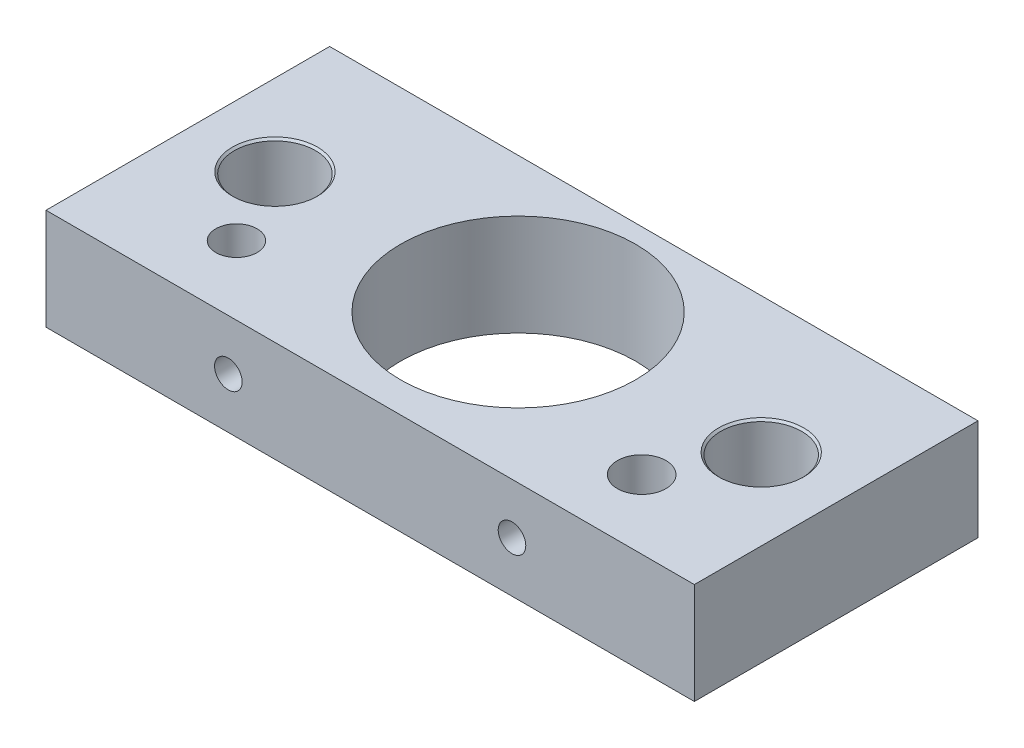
ISO-10303-21;
HEADER;
FILE_DESCRIPTION(('STEP AP214'),'2;1');
FILE_NAME('part.step','',(''),(''),'','','');
FILE_SCHEMA(('AUTOMOTIVE_DESIGN { 1 0 10303 214 1 1 1 1 }'));
ENDSEC;
DATA;
#1=APPLICATION_CONTEXT('core data for automotive mechanical design processes');
#2=APPLICATION_PROTOCOL_DEFINITION('international standard','automotive_design',2000,#1);
#3=PRODUCT_CONTEXT('',#1,'mechanical');
#4=PRODUCT('Part','Part','',(#3));
#5=PRODUCT_RELATED_PRODUCT_CATEGORY('part','',(#4));
#6=PRODUCT_DEFINITION_FORMATION('','',#4);
#7=PRODUCT_DEFINITION_CONTEXT('part definition',#1,'design');
#8=PRODUCT_DEFINITION('design','',#6,#7);
#9=PRODUCT_DEFINITION_SHAPE('','',#8);
#10=(LENGTH_UNIT() NAMED_UNIT(*) SI_UNIT(.MILLI.,.METRE.));
#11=(NAMED_UNIT(*) PLANE_ANGLE_UNIT() SI_UNIT($,.RADIAN.));
#12=(NAMED_UNIT(*) SI_UNIT($,.STERADIAN.) SOLID_ANGLE_UNIT());
#13=UNCERTAINTY_MEASURE_WITH_UNIT(LENGTH_MEASURE(1.E-05),#10,'distance_accuracy_value','');
#14=(GEOMETRIC_REPRESENTATION_CONTEXT(3) GLOBAL_UNCERTAINTY_ASSIGNED_CONTEXT((#13)) GLOBAL_UNIT_ASSIGNED_CONTEXT((#10,
#11,#12)) REPRESENTATION_CONTEXT('',''));
#15=CARTESIAN_POINT('',(0.,0.,0.));
#16=DIRECTION('',(0.,0.,1.));
#17=DIRECTION('',(1.,0.,0.));
#18=AXIS2_PLACEMENT_3D('',#15,#16,#17);
#19=CARTESIAN_POINT('',(0.,25.,0.));
#20=DIRECTION('',(1.,0.,0.));
#21=DIRECTION('',(0.,0.,-1.));
#22=AXIS2_PLACEMENT_3D('',#19,#20,#21);
#23=PLANE('',#22);
#24=DIRECTION('',(0.,0.,1.));
#25=VECTOR('',#24,1.);
#26=CARTESIAN_POINT('',(0.,0.,0.));
#27=LINE('',#26,#25);
#28=CARTESIAN_POINT('',(0.,0.,-70.));
#29=VERTEX_POINT('',#28);
#30=CARTESIAN_POINT('',(0.,0.,0.));
#31=VERTEX_POINT('',#30);
#32=EDGE_CURVE('E9218',#29,#31,#27,.T.);
#33=ORIENTED_EDGE('',*,*,#32,.T.);
#34=DIRECTION('',(0.,-1.,0.));
#35=VECTOR('',#34,1.);
#36=CARTESIAN_POINT('',(0.,25.,0.));
#37=LINE('',#36,#35);
#38=CARTESIAN_POINT('',(0.,25.,0.));
#39=VERTEX_POINT('',#38);
#40=EDGE_CURVE('E11',#39,#31,#37,.T.);
#41=ORIENTED_EDGE('',*,*,#40,.F.);
#42=DIRECTION('',(0.,0.,1.));
#43=VECTOR('',#42,1.);
#44=CARTESIAN_POINT('',(0.,25.,0.));
#45=LINE('',#44,#43);
#46=CARTESIAN_POINT('',(0.,25.,-70.));
#47=VERTEX_POINT('',#46);
#48=EDGE_CURVE('E9241',#47,#39,#45,.T.);
#49=ORIENTED_EDGE('',*,*,#48,.F.);
#50=DIRECTION('',(0.,-1.,0.));
#51=VECTOR('',#50,1.);
#52=CARTESIAN_POINT('',(0.,25.,-70.));
#53=LINE('',#52,#51);
#54=EDGE_CURVE('E9230',#47,#29,#53,.T.);
#55=ORIENTED_EDGE('',*,*,#54,.T.);
#56=EDGE_LOOP('',(#33,#41,#49,#55));
#57=FACE_BOUND('',#56,.T.);
#58=ADVANCED_FACE('F9174',(#57),#23,.F.);
#59=CARTESIAN_POINT('',(0.,25.,0.));
#60=DIRECTION('',(0.,0.,-1.));
#61=DIRECTION('',(-1.,0.,0.));
#62=AXIS2_PLACEMENT_3D('',#59,#60,#61);
#63=PLANE('',#62);
#64=CARTESIAN_POINT('',(115.,12.5,0.));
#65=DIRECTION('',(0.,0.,1.));
#66=DIRECTION('',(1.,0.,0.));
#67=AXIS2_PLACEMENT_3D('',#64,#65,#66);
#68=CIRCLE('',#67,3.39999999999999);
#69=CARTESIAN_POINT('',(118.4,12.5,0.));
#70=VERTEX_POINT('',#69);
#71=EDGE_CURVE('E9282',#70,#70,#68,.T.);
#72=ORIENTED_EDGE('',*,*,#71,.F.);
#73=EDGE_LOOP('',(#72));
#74=FACE_BOUND('',#73,.T.);
#75=CARTESIAN_POINT('',(45.,12.5,0.));
#76=DIRECTION('',(0.,0.,1.));
#77=DIRECTION('',(1.,0.,0.));
#78=AXIS2_PLACEMENT_3D('',#75,#76,#77);
#79=CIRCLE('',#78,3.39999999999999);
#80=CARTESIAN_POINT('',(48.4,12.5,0.));
#81=VERTEX_POINT('',#80);
#82=EDGE_CURVE('E9285',#81,#81,#79,.T.);
#83=ORIENTED_EDGE('',*,*,#82,.F.);
#84=EDGE_LOOP('',(#83));
#85=FACE_BOUND('',#84,.T.);
#86=DIRECTION('',(1.,0.,0.));
#87=VECTOR('',#86,1.);
#88=CARTESIAN_POINT('',(0.,0.,0.));
#89=LINE('',#88,#87);
#90=CARTESIAN_POINT('',(160.,0.,0.));
#91=VERTEX_POINT('',#90);
#92=EDGE_CURVE('E9214',#31,#91,#89,.T.);
#93=ORIENTED_EDGE('',*,*,#92,.T.);
#94=DIRECTION('',(0.,-1.,0.));
#95=VECTOR('',#94,1.);
#96=CARTESIAN_POINT('',(160.,25.,0.));
#97=LINE('',#96,#95);
#98=CARTESIAN_POINT('',(160.,25.,0.));
#99=VERTEX_POINT('',#98);
#100=EDGE_CURVE('E9181',#99,#91,#97,.T.);
#101=ORIENTED_EDGE('',*,*,#100,.F.);
#102=DIRECTION('',(1.,0.,0.));
#103=VECTOR('',#102,1.);
#104=CARTESIAN_POINT('',(0.,25.,0.));
#105=LINE('',#104,#103);
#106=EDGE_CURVE('E9226',#39,#99,#105,.T.);
#107=ORIENTED_EDGE('',*,*,#106,.F.);
#108=ORIENTED_EDGE('',*,*,#40,.T.);
#109=EDGE_LOOP('',(#93,#101,#107,#108));
#110=FACE_BOUND('',#109,.T.);
#111=ADVANCED_FACE('F9225',(#74,#85,#110),#63,.F.);
#112=CARTESIAN_POINT('',(160.,25.,0.));
#113=DIRECTION('',(-1.,0.,0.));
#114=DIRECTION('',(0.,0.,1.));
#115=AXIS2_PLACEMENT_3D('',#112,#113,#114);
#116=PLANE('',#115);
#117=DIRECTION('',(0.,0.,-1.));
#118=VECTOR('',#117,1.);
#119=CARTESIAN_POINT('',(160.,0.,0.));
#120=LINE('',#119,#118);
#121=CARTESIAN_POINT('',(160.,0.,-70.));
#122=VERTEX_POINT('',#121);
#123=EDGE_CURVE('E9219',#91,#122,#120,.T.);
#124=ORIENTED_EDGE('',*,*,#123,.T.);
#125=DIRECTION('',(0.,-1.,0.));
#126=VECTOR('',#125,1.);
#127=CARTESIAN_POINT('',(160.,25.,-70.));
#128=LINE('',#127,#126);
#129=CARTESIAN_POINT('',(160.,25.,-70.));
#130=VERTEX_POINT('',#129);
#131=EDGE_CURVE('E9247',#130,#122,#128,.T.);
#132=ORIENTED_EDGE('',*,*,#131,.F.);
#133=DIRECTION('',(0.,0.,-1.));
#134=VECTOR('',#133,1.);
#135=CARTESIAN_POINT('',(160.,25.,0.));
#136=LINE('',#135,#134);
#137=EDGE_CURVE('E9193',#99,#130,#136,.T.);
#138=ORIENTED_EDGE('',*,*,#137,.F.);
#139=ORIENTED_EDGE('',*,*,#100,.T.);
#140=EDGE_LOOP('',(#124,#132,#138,#139));
#141=FACE_BOUND('',#140,.T.);
#142=ADVANCED_FACE('F9250',(#141),#116,.F.);
#143=CARTESIAN_POINT('',(0.,25.,-70.));
#144=DIRECTION('',(0.,0.,1.));
#145=DIRECTION('',(1.,0.,0.));
#146=AXIS2_PLACEMENT_3D('',#143,#144,#145);
#147=PLANE('',#146);
#148=CARTESIAN_POINT('',(115.,12.5,-70.));
#149=DIRECTION('',(0.,0.,1.));
#150=DIRECTION('',(1.,0.,0.));
#151=AXIS2_PLACEMENT_3D('',#148,#149,#150);
#152=CIRCLE('',#151,3.39999999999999);
#153=CARTESIAN_POINT('',(118.4,12.5,-70.));
#154=VERTEX_POINT('',#153);
#155=EDGE_CURVE('E9382',#154,#154,#152,.T.);
#156=ORIENTED_EDGE('',*,*,#155,.T.);
#157=EDGE_LOOP('',(#156));
#158=FACE_BOUND('',#157,.T.);
#159=CARTESIAN_POINT('',(45.,12.5,-70.));
#160=DIRECTION('',(0.,0.,1.));
#161=DIRECTION('',(1.,0.,0.));
#162=AXIS2_PLACEMENT_3D('',#159,#160,#161);
#163=CIRCLE('',#162,3.39999999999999);
#164=CARTESIAN_POINT('',(48.4,12.5,-70.));
#165=VERTEX_POINT('',#164);
#166=EDGE_CURVE('E9288',#165,#165,#163,.T.);
#167=ORIENTED_EDGE('',*,*,#166,.T.);
#168=EDGE_LOOP('',(#167));
#169=FACE_BOUND('',#168,.T.);
#170=DIRECTION('',(-1.,0.,0.));
#171=VECTOR('',#170,1.);
#172=CARTESIAN_POINT('',(0.,0.,-70.));
#173=LINE('',#172,#171);
#174=EDGE_CURVE('E9239',#122,#29,#173,.T.);
#175=ORIENTED_EDGE('',*,*,#174,.T.);
#176=ORIENTED_EDGE('',*,*,#54,.F.);
#177=DIRECTION('',(-1.,0.,0.));
#178=VECTOR('',#177,1.);
#179=CARTESIAN_POINT('',(0.,25.,-70.));
#180=LINE('',#179,#178);
#181=EDGE_CURVE('E9188',#130,#47,#180,.T.);
#182=ORIENTED_EDGE('',*,*,#181,.F.);
#183=ORIENTED_EDGE('',*,*,#131,.T.);
#184=EDGE_LOOP('',(#175,#176,#182,#183));
#185=FACE_BOUND('',#184,.T.);
#186=ADVANCED_FACE('F9252',(#158,#169,#185),#147,.F.);
#187=CARTESIAN_POINT('',(0.,25.,-70.));
#188=DIRECTION('',(0.,-1.,0.));
#189=DIRECTION('',(0.,0.,-1.));
#190=AXIS2_PLACEMENT_3D('',#187,#188,#189);
#191=PLANE('',#190);
#192=CARTESIAN_POINT('',(80.,25.,-36.5));
#193=DIRECTION('',(0.,-1.,0.));
#194=DIRECTION('',(0.,0.,-1.));
#195=AXIS2_PLACEMENT_3D('',#192,#193,#194);
#196=CIRCLE('',#195,29.);
#197=CARTESIAN_POINT('',(80.,25.,-65.5));
#198=VERTEX_POINT('',#197);
#199=EDGE_CURVE('E9363',#198,#198,#196,.T.);
#200=ORIENTED_EDGE('',*,*,#199,.T.);
#201=EDGE_LOOP('',(#200));
#202=FACE_BOUND('',#201,.T.);
#203=CARTESIAN_POINT('',(30.,25.,-17.));
#204=DIRECTION('',(0.,-1.,0.));
#205=DIRECTION('',(0.,0.,-1.));
#206=AXIS2_PLACEMENT_3D('',#203,#204,#205);
#207=CIRCLE('',#206,5.09999999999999);
#208=CARTESIAN_POINT('',(30.,25.,-22.1));
#209=VERTEX_POINT('',#208);
#210=EDGE_CURVE('E9368',#209,#209,#207,.T.);
#211=ORIENTED_EDGE('',*,*,#210,.T.);
#212=EDGE_LOOP('',(#211));
#213=FACE_BOUND('',#212,.T.);
#214=CARTESIAN_POINT('',(130.,25.,-17.));
#215=DIRECTION('',(0.,-1.,0.));
#216=DIRECTION('',(0.,0.,-1.));
#217=AXIS2_PLACEMENT_3D('',#214,#215,#216);
#218=CIRCLE('',#217,6.00000000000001);
#219=CARTESIAN_POINT('',(130.,25.,-23.));
#220=VERTEX_POINT('',#219);
#221=EDGE_CURVE('E9376',#220,#220,#218,.T.);
#222=ORIENTED_EDGE('',*,*,#221,.T.);
#223=EDGE_LOOP('',(#222));
#224=FACE_BOUND('',#223,.T.);
#225=CARTESIAN_POINT('',(140.,25.,-36.5));
#226=DIRECTION('',(0.,-1.,0.));
#227=DIRECTION('',(0.,0.,-1.));
#228=AXIS2_PLACEMENT_3D('',#225,#226,#227);
#229=CIRCLE('',#228,10.5);
#230=CARTESIAN_POINT('',(140.,25.,-47.));
#231=VERTEX_POINT('',#230);
#232=EDGE_CURVE('E9287',#231,#231,#229,.T.);
#233=ORIENTED_EDGE('',*,*,#232,.T.);
#234=EDGE_LOOP('',(#233));
#235=FACE_BOUND('',#234,.T.);
#236=CARTESIAN_POINT('',(20.,25.,-36.5));
#237=DIRECTION('',(0.,-1.,0.));
#238=DIRECTION('',(0.,0.,-1.));
#239=AXIS2_PLACEMENT_3D('',#236,#237,#238);
#240=CIRCLE('',#239,10.5);
#241=CARTESIAN_POINT('',(20.,25.,-47.));
#242=VERTEX_POINT('',#241);
#243=EDGE_CURVE('E9305',#242,#242,#240,.T.);
#244=ORIENTED_EDGE('',*,*,#243,.T.);
#245=EDGE_LOOP('',(#244));
#246=FACE_BOUND('',#245,.T.);
#247=ORIENTED_EDGE('',*,*,#48,.T.);
#248=ORIENTED_EDGE('',*,*,#106,.T.);
#249=ORIENTED_EDGE('',*,*,#137,.T.);
#250=ORIENTED_EDGE('',*,*,#181,.T.);
#251=EDGE_LOOP('',(#247,#248,#249,#250));
#252=FACE_BOUND('',#251,.T.);
#253=ADVANCED_FACE('F9253',(#202,#213,#224,#235,#246,#252),#191,.F.);
#254=CARTESIAN_POINT('',(0.,0.,-70.));
#255=DIRECTION('',(0.,-1.,0.));
#256=DIRECTION('',(0.,0.,-1.));
#257=AXIS2_PLACEMENT_3D('',#254,#255,#256);
#258=PLANE('',#257);
#259=CARTESIAN_POINT('',(80.,0.,-36.5));
#260=DIRECTION('',(0.,-1.,0.));
#261=DIRECTION('',(0.,0.,-1.));
#262=AXIS2_PLACEMENT_3D('',#259,#260,#261);
#263=CIRCLE('',#262,29.);
#264=CARTESIAN_POINT('',(80.,0.,-65.5));
#265=VERTEX_POINT('',#264);
#266=EDGE_CURVE('E9366',#265,#265,#263,.T.);
#267=ORIENTED_EDGE('',*,*,#266,.F.);
#268=EDGE_LOOP('',(#267));
#269=FACE_BOUND('',#268,.T.);
#270=CARTESIAN_POINT('',(30.,0.,-17.));
#271=DIRECTION('',(0.,-1.,0.));
#272=DIRECTION('',(0.,0.,-1.));
#273=AXIS2_PLACEMENT_3D('',#270,#271,#272);
#274=CIRCLE('',#273,5.09999999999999);
#275=CARTESIAN_POINT('',(30.,0.,-22.1));
#276=VERTEX_POINT('',#275);
#277=EDGE_CURVE('E9373',#276,#276,#274,.T.);
#278=ORIENTED_EDGE('',*,*,#277,.F.);
#279=EDGE_LOOP('',(#278));
#280=FACE_BOUND('',#279,.T.);
#281=CARTESIAN_POINT('',(130.,0.,-17.));
#282=DIRECTION('',(0.,-1.,0.));
#283=DIRECTION('',(0.,0.,-1.));
#284=AXIS2_PLACEMENT_3D('',#281,#282,#283);
#285=CIRCLE('',#284,6.00000000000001);
#286=CARTESIAN_POINT('',(130.,0.,-23.));
#287=VERTEX_POINT('',#286);
#288=EDGE_CURVE('E9379',#287,#287,#285,.T.);
#289=ORIENTED_EDGE('',*,*,#288,.F.);
#290=EDGE_LOOP('',(#289));
#291=FACE_BOUND('',#290,.T.);
#292=CARTESIAN_POINT('',(140.,0.,-36.5));
#293=DIRECTION('',(0.,-1.,0.));
#294=DIRECTION('',(0.,0.,-1.));
#295=AXIS2_PLACEMENT_3D('',#292,#293,#294);
#296=CIRCLE('',#295,10.5);
#297=CARTESIAN_POINT('',(140.,0.,-47.));
#298=VERTEX_POINT('',#297);
#299=EDGE_CURVE('E9302',#298,#298,#296,.T.);
#300=ORIENTED_EDGE('',*,*,#299,.F.);
#301=EDGE_LOOP('',(#300));
#302=FACE_BOUND('',#301,.T.);
#303=CARTESIAN_POINT('',(20.,0.,-36.5));
#304=DIRECTION('',(0.,-1.,0.));
#305=DIRECTION('',(0.,0.,-1.));
#306=AXIS2_PLACEMENT_3D('',#303,#304,#305);
#307=CIRCLE('',#306,10.5);
#308=CARTESIAN_POINT('',(20.,0.,-47.));
#309=VERTEX_POINT('',#308);
#310=EDGE_CURVE('E9231',#309,#309,#307,.T.);
#311=ORIENTED_EDGE('',*,*,#310,.F.);
#312=EDGE_LOOP('',(#311));
#313=FACE_BOUND('',#312,.T.);
#314=ORIENTED_EDGE('',*,*,#32,.F.);
#315=ORIENTED_EDGE('',*,*,#174,.F.);
#316=ORIENTED_EDGE('',*,*,#123,.F.);
#317=ORIENTED_EDGE('',*,*,#92,.F.);
#318=EDGE_LOOP('',(#314,#315,#316,#317));
#319=FACE_BOUND('',#318,.T.);
#320=ADVANCED_FACE('F9215',(#269,#280,#291,#302,#313,#319),#258,.T.);
#321=CARTESIAN_POINT('',(20.,0.,-36.5));
#322=DIRECTION('',(0.,-1.,0.));
#323=DIRECTION('',(0.,0.,-1.));
#324=AXIS2_PLACEMENT_3D('',#321,#322,#323);
#325=CONICAL_SURFACE('',#324,10.5,0.785398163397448);
#326=CARTESIAN_POINT('',(20.,0.500000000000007,-36.5));
#327=DIRECTION('',(0.,-1.,0.));
#328=DIRECTION('',(0.,0.,-1.));
#329=AXIS2_PLACEMENT_3D('',#326,#327,#328);
#330=CIRCLE('',#329,9.99999999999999);
#331=CARTESIAN_POINT('',(20.,0.500000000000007,-46.5));
#332=VERTEX_POINT('',#331);
#333=EDGE_CURVE('E9234',#332,#332,#330,.T.);
#334=ORIENTED_EDGE('',*,*,#333,.F.);
#335=EDGE_LOOP('',(#334));
#336=FACE_BOUND('',#335,.T.);
#337=ORIENTED_EDGE('',*,*,#310,.T.);
#338=EDGE_LOOP('',(#337));
#339=FACE_BOUND('',#338,.T.);
#340=ADVANCED_FACE('F9261',(#336,#339),#325,.F.);
#341=CARTESIAN_POINT('',(20.,0.,-36.5));
#342=DIRECTION('',(0.,-1.,0.));
#343=DIRECTION('',(0.,0.,-1.));
#344=AXIS2_PLACEMENT_3D('',#341,#342,#343);
#345=CYLINDRICAL_SURFACE('',#344,9.99999999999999);
#346=CARTESIAN_POINT('',(20.,24.5,-36.5));
#347=DIRECTION('',(0.,-1.,0.));
#348=DIRECTION('',(0.,0.,-1.));
#349=AXIS2_PLACEMENT_3D('',#346,#347,#348);
#350=CIRCLE('',#349,9.99999999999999);
#351=CARTESIAN_POINT('',(20.,24.5,-46.5));
#352=VERTEX_POINT('',#351);
#353=EDGE_CURVE('E9308',#352,#352,#350,.T.);
#354=ORIENTED_EDGE('',*,*,#353,.F.);
#355=EDGE_LOOP('',(#354));
#356=FACE_BOUND('',#355,.T.);
#357=ORIENTED_EDGE('',*,*,#333,.T.);
#358=EDGE_LOOP('',(#357));
#359=FACE_BOUND('',#358,.T.);
#360=ADVANCED_FACE('F9313',(#356,#359),#345,.F.);
#361=CARTESIAN_POINT('',(20.,24.5,-36.5));
#362=DIRECTION('',(0.,1.,0.));
#363=DIRECTION('',(0.,0.,1.));
#364=AXIS2_PLACEMENT_3D('',#361,#362,#363);
#365=CONICAL_SURFACE('',#364,9.99999999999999,0.785398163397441);
#366=ORIENTED_EDGE('',*,*,#243,.F.);
#367=EDGE_LOOP('',(#366));
#368=FACE_BOUND('',#367,.T.);
#369=ORIENTED_EDGE('',*,*,#353,.T.);
#370=EDGE_LOOP('',(#369));
#371=FACE_BOUND('',#370,.T.);
#372=ADVANCED_FACE('F9323',(#368,#371),#365,.F.);
#373=CARTESIAN_POINT('',(140.,0.,-36.5));
#374=DIRECTION('',(0.,-1.,0.));
#375=DIRECTION('',(0.,0.,-1.));
#376=AXIS2_PLACEMENT_3D('',#373,#374,#375);
#377=CONICAL_SURFACE('',#376,10.5,0.785398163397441);
#378=CARTESIAN_POINT('',(140.,0.500000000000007,-36.5));
#379=DIRECTION('',(0.,-1.,0.));
#380=DIRECTION('',(0.,0.,-1.));
#381=AXIS2_PLACEMENT_3D('',#378,#379,#380);
#382=CIRCLE('',#381,10.);
#383=CARTESIAN_POINT('',(140.,0.500000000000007,-46.5));
#384=VERTEX_POINT('',#383);
#385=EDGE_CURVE('E9299',#384,#384,#382,.T.);
#386=ORIENTED_EDGE('',*,*,#385,.F.);
#387=EDGE_LOOP('',(#386));
#388=FACE_BOUND('',#387,.T.);
#389=ORIENTED_EDGE('',*,*,#299,.T.);
#390=EDGE_LOOP('',(#389));
#391=FACE_BOUND('',#390,.T.);
#392=ADVANCED_FACE('F9329',(#388,#391),#377,.F.);
#393=CARTESIAN_POINT('',(140.,0.,-36.5));
#394=DIRECTION('',(0.,-1.,0.));
#395=DIRECTION('',(0.,0.,-1.));
#396=AXIS2_PLACEMENT_3D('',#393,#394,#395);
#397=CYLINDRICAL_SURFACE('',#396,9.99999999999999);
#398=CARTESIAN_POINT('',(140.,24.5,-36.5));
#399=DIRECTION('',(0.,-1.,0.));
#400=DIRECTION('',(0.,0.,-1.));
#401=AXIS2_PLACEMENT_3D('',#398,#399,#400);
#402=CIRCLE('',#401,9.99999999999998);
#403=CARTESIAN_POINT('',(140.,24.5,-46.5));
#404=VERTEX_POINT('',#403);
#405=EDGE_CURVE('E9291',#404,#404,#402,.T.);
#406=ORIENTED_EDGE('',*,*,#405,.F.);
#407=EDGE_LOOP('',(#406));
#408=FACE_BOUND('',#407,.T.);
#409=ORIENTED_EDGE('',*,*,#385,.T.);
#410=EDGE_LOOP('',(#409));
#411=FACE_BOUND('',#410,.T.);
#412=ADVANCED_FACE('F9333',(#408,#411),#397,.F.);
#413=CARTESIAN_POINT('',(140.,24.5,-36.5));
#414=DIRECTION('',(0.,1.,0.));
#415=DIRECTION('',(0.,0.,1.));
#416=AXIS2_PLACEMENT_3D('',#413,#414,#415);
#417=CONICAL_SURFACE('',#416,9.99999999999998,0.785398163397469);
#418=ORIENTED_EDGE('',*,*,#232,.F.);
#419=EDGE_LOOP('',(#418));
#420=FACE_BOUND('',#419,.T.);
#421=ORIENTED_EDGE('',*,*,#405,.T.);
#422=EDGE_LOOP('',(#421));
#423=FACE_BOUND('',#422,.T.);
#424=ADVANCED_FACE('F9337',(#420,#423),#417,.F.);
#425=CARTESIAN_POINT('',(45.,12.5,0.));
#426=DIRECTION('',(0.,0.,1.));
#427=DIRECTION('',(1.,0.,0.));
#428=AXIS2_PLACEMENT_3D('',#425,#426,#427);
#429=CYLINDRICAL_SURFACE('',#428,3.39999999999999);
#430=ORIENTED_EDGE('',*,*,#166,.F.);
#431=EDGE_LOOP('',(#430));
#432=FACE_BOUND('',#431,.T.);
#433=ORIENTED_EDGE('',*,*,#82,.T.);
#434=EDGE_LOOP('',(#433));
#435=FACE_BOUND('',#434,.T.);
#436=ADVANCED_FACE('F9341',(#432,#435),#429,.F.);
#437=CARTESIAN_POINT('',(115.,12.5,0.));
#438=DIRECTION('',(0.,0.,1.));
#439=DIRECTION('',(1.,0.,0.));
#440=AXIS2_PLACEMENT_3D('',#437,#438,#439);
#441=CYLINDRICAL_SURFACE('',#440,3.39999999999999);
#442=ORIENTED_EDGE('',*,*,#155,.F.);
#443=EDGE_LOOP('',(#442));
#444=FACE_BOUND('',#443,.T.);
#445=ORIENTED_EDGE('',*,*,#71,.T.);
#446=EDGE_LOOP('',(#445));
#447=FACE_BOUND('',#446,.T.);
#448=ADVANCED_FACE('F9344',(#444,#447),#441,.F.);
#449=CARTESIAN_POINT('',(130.,0.,-17.));
#450=DIRECTION('',(0.,-1.,0.));
#451=DIRECTION('',(0.,0.,-1.));
#452=AXIS2_PLACEMENT_3D('',#449,#450,#451);
#453=CYLINDRICAL_SURFACE('',#452,6.00000000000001);
#454=ORIENTED_EDGE('',*,*,#221,.F.);
#455=EDGE_LOOP('',(#454));
#456=FACE_BOUND('',#455,.T.);
#457=ORIENTED_EDGE('',*,*,#288,.T.);
#458=EDGE_LOOP('',(#457));
#459=FACE_BOUND('',#458,.T.);
#460=ADVANCED_FACE('F9348',(#456,#459),#453,.F.);
#461=CARTESIAN_POINT('',(30.,0.,-17.));
#462=DIRECTION('',(0.,-1.,0.));
#463=DIRECTION('',(0.,0.,-1.));
#464=AXIS2_PLACEMENT_3D('',#461,#462,#463);
#465=CYLINDRICAL_SURFACE('',#464,5.09999999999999);
#466=ORIENTED_EDGE('',*,*,#210,.F.);
#467=EDGE_LOOP('',(#466));
#468=FACE_BOUND('',#467,.T.);
#469=ORIENTED_EDGE('',*,*,#277,.T.);
#470=EDGE_LOOP('',(#469));
#471=FACE_BOUND('',#470,.T.);
#472=ADVANCED_FACE('F9352',(#468,#471),#465,.F.);
#473=CARTESIAN_POINT('',(80.,25.,-36.5));
#474=DIRECTION('',(0.,-1.,0.));
#475=DIRECTION('',(0.,0.,-1.));
#476=AXIS2_PLACEMENT_3D('',#473,#474,#475);
#477=CYLINDRICAL_SURFACE('',#476,29.);
#478=ORIENTED_EDGE('',*,*,#199,.F.);
#479=EDGE_LOOP('',(#478));
#480=FACE_BOUND('',#479,.T.);
#481=ORIENTED_EDGE('',*,*,#266,.T.);
#482=EDGE_LOOP('',(#481));
#483=FACE_BOUND('',#482,.T.);
#484=ADVANCED_FACE('F9355',(#480,#483),#477,.F.);
#485=CLOSED_SHELL('',(#58,#111,#142,#186,#253,#320,#340,#360,#372,#392,#412,#424,#436,#448,#460,
#472,#484));
#486=MANIFOLD_SOLID_BREP('B2',#485);
#487=ADVANCED_BREP_SHAPE_REPRESENTATION('',(#18,#486),#14);
#488=SHAPE_DEFINITION_REPRESENTATION(#9,#487);
ENDSEC;
END-ISO-10303-21;
